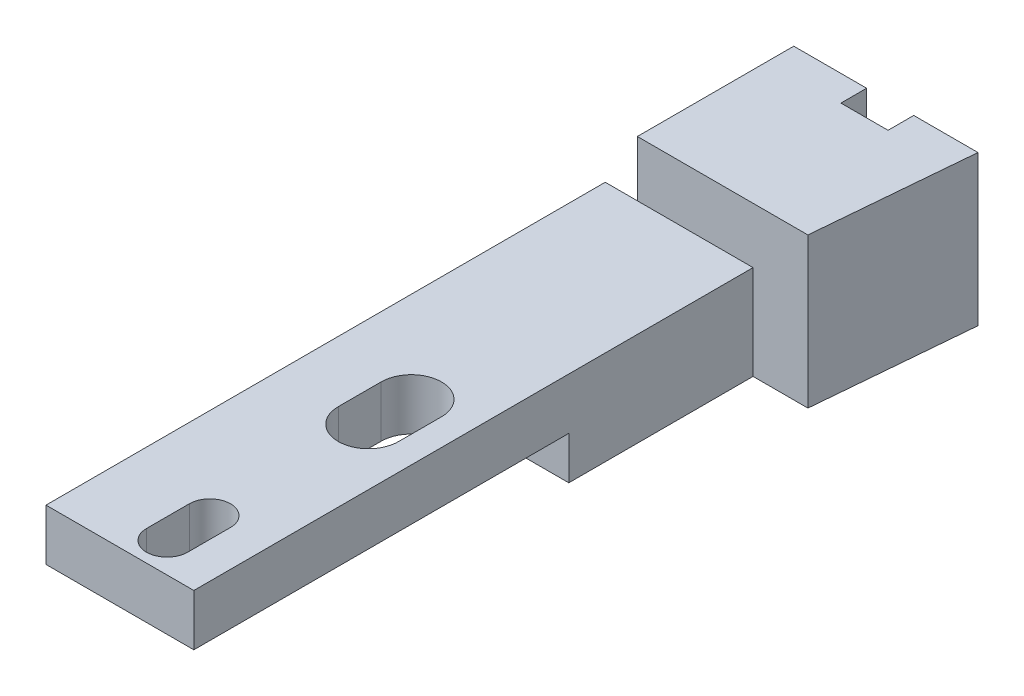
ISO-10303-21;
HEADER;
FILE_DESCRIPTION(('STEP AP214'),'2;1');
FILE_NAME('part.step','',(''),(''),'','','');
FILE_SCHEMA(('AUTOMOTIVE_DESIGN { 1 0 10303 214 1 1 1 1 }'));
ENDSEC;
DATA;
#1=APPLICATION_CONTEXT('core data for automotive mechanical design processes');
#2=APPLICATION_PROTOCOL_DEFINITION('international standard','automotive_design',2000,#1);
#3=PRODUCT_CONTEXT('',#1,'mechanical');
#4=PRODUCT('Part','Part','',(#3));
#5=PRODUCT_RELATED_PRODUCT_CATEGORY('part','',(#4));
#6=PRODUCT_DEFINITION_FORMATION('','',#4);
#7=PRODUCT_DEFINITION_CONTEXT('part definition',#1,'design');
#8=PRODUCT_DEFINITION('design','',#6,#7);
#9=PRODUCT_DEFINITION_SHAPE('','',#8);
#10=(LENGTH_UNIT() NAMED_UNIT(*) SI_UNIT(.MILLI.,.METRE.));
#11=(NAMED_UNIT(*) PLANE_ANGLE_UNIT() SI_UNIT($,.RADIAN.));
#12=(NAMED_UNIT(*) SI_UNIT($,.STERADIAN.) SOLID_ANGLE_UNIT());
#13=UNCERTAINTY_MEASURE_WITH_UNIT(LENGTH_MEASURE(1.E-05),#10,'distance_accuracy_value','');
#14=(GEOMETRIC_REPRESENTATION_CONTEXT(3) GLOBAL_UNCERTAINTY_ASSIGNED_CONTEXT((#13)) GLOBAL_UNIT_ASSIGNED_CONTEXT((#10,
#11,#12)) REPRESENTATION_CONTEXT('',''));
#15=CARTESIAN_POINT('',(0.,0.,0.));
#16=DIRECTION('',(0.,0.,1.));
#17=DIRECTION('',(1.,0.,0.));
#18=AXIS2_PLACEMENT_3D('',#15,#16,#17);
#19=CARTESIAN_POINT('',(-6.096,12.7,33.02));
#20=DIRECTION('',(0.,1.,0.));
#21=DIRECTION('',(0.,0.,1.));
#22=AXIS2_PLACEMENT_3D('',#19,#20,#21);
#23=PLANE('',#22);
#24=DIRECTION('',(0.,0.,1.));
#25=VECTOR('',#24,1.);
#26=CARTESIAN_POINT('',(0.761999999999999,12.7,9.271));
#27=LINE('',#26,#25);
#28=CARTESIAN_POINT('',(0.761999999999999,12.7,9.271));
#29=VERTEX_POINT('',#28);
#30=CARTESIAN_POINT('',(0.761999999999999,12.7,20.193));
#31=VERTEX_POINT('',#30);
#32=EDGE_CURVE('E275',#29,#31,#27,.T.);
#33=ORIENTED_EDGE('',*,*,#32,.T.);
#34=DIRECTION('',(1.,0.,0.));
#35=VECTOR('',#34,1.);
#36=CARTESIAN_POINT('',(-8.001025,12.7,20.193));
#37=LINE('',#36,#35);
#38=CARTESIAN_POINT('',(-8.001,12.7,20.193));
#39=VERTEX_POINT('',#38);
#40=EDGE_CURVE('E256',#39,#31,#37,.T.);
#41=ORIENTED_EDGE('',*,*,#40,.F.);
#42=DIRECTION('',(0.,0.,1.));
#43=VECTOR('',#42,1.);
#44=CARTESIAN_POINT('',(-8.001,12.7,9.271));
#45=LINE('',#44,#43);
#46=CARTESIAN_POINT('',(-8.001,12.7,9.271));
#47=VERTEX_POINT('',#46);
#48=EDGE_CURVE('E265',#47,#39,#45,.T.);
#49=ORIENTED_EDGE('',*,*,#48,.F.);
#50=DIRECTION('',(1.,0.,0.));
#51=VECTOR('',#50,1.);
#52=CARTESIAN_POINT('',(-9.271,12.7,9.271));
#53=LINE('',#52,#51);
#54=CARTESIAN_POINT('',(-6.096,12.7,9.271));
#55=VERTEX_POINT('',#54);
#56=EDGE_CURVE('E321',#47,#55,#53,.T.);
#57=ORIENTED_EDGE('',*,*,#56,.T.);
#58=DIRECTION('',(0.,0.,-1.));
#59=VECTOR('',#58,1.);
#60=CARTESIAN_POINT('',(-6.096,12.7,33.02));
#61=LINE('',#60,#59);
#62=CARTESIAN_POINT('',(-6.096,12.7,3.81));
#63=VERTEX_POINT('',#62);
#64=EDGE_CURVE('E336',#55,#63,#61,.T.);
#65=ORIENTED_EDGE('',*,*,#64,.T.);
#66=DIRECTION('',(-1.,0.,0.));
#67=VECTOR('',#66,1.);
#68=CARTESIAN_POINT('',(-4.953,12.7,3.81));
#69=LINE('',#68,#67);
#70=CARTESIAN_POINT('',(-4.953,12.7,3.81));
#71=VERTEX_POINT('',#70);
#72=EDGE_CURVE('E290',#71,#63,#69,.T.);
#73=ORIENTED_EDGE('',*,*,#72,.F.);
#74=DIRECTION('',(0.,0.,1.));
#75=VECTOR('',#74,1.);
#76=CARTESIAN_POINT('',(-4.953,12.7,0.));
#77=LINE('',#76,#75);
#78=CARTESIAN_POINT('',(-4.953,12.7,0.));
#79=VERTEX_POINT('',#78);
#80=EDGE_CURVE('E286',#79,#71,#77,.T.);
#81=ORIENTED_EDGE('',*,*,#80,.F.);
#82=DIRECTION('',(1.,0.,0.));
#83=VECTOR('',#82,1.);
#84=CARTESIAN_POINT('',(-6.096,12.7,0.));
#85=LINE('',#84,#83);
#86=CARTESIAN_POINT('',(-1.778,12.7,0.));
#87=VERTEX_POINT('',#86);
#88=EDGE_CURVE('E743',#79,#87,#85,.T.);
#89=ORIENTED_EDGE('',*,*,#88,.T.);
#90=DIRECTION('',(0.,0.,-1.));
#91=VECTOR('',#90,1.);
#92=CARTESIAN_POINT('',(-1.778,12.7,1.524));
#93=LINE('',#92,#91);
#94=CARTESIAN_POINT('',(-1.778,12.7,1.524));
#95=VERTEX_POINT('',#94);
#96=EDGE_CURVE('E771',#95,#87,#93,.T.);
#97=ORIENTED_EDGE('',*,*,#96,.F.);
#98=DIRECTION('',(-1.,0.,0.));
#99=VECTOR('',#98,1.);
#100=CARTESIAN_POINT('',(1.016,12.7,1.524));
#101=LINE('',#100,#99);
#102=CARTESIAN_POINT('',(1.016,12.7,1.524));
#103=VERTEX_POINT('',#102);
#104=EDGE_CURVE('E782',#103,#95,#101,.T.);
#105=ORIENTED_EDGE('',*,*,#104,.F.);
#106=DIRECTION('',(0.,0.,-1.));
#107=VECTOR('',#106,1.);
#108=CARTESIAN_POINT('',(1.016,12.7,1.524));
#109=LINE('',#108,#107);
#110=CARTESIAN_POINT('',(1.016,12.7,0.));
#111=VERTEX_POINT('',#110);
#112=EDGE_CURVE('E778',#103,#111,#109,.T.);
#113=ORIENTED_EDGE('',*,*,#112,.T.);
#114=CARTESIAN_POINT('',(4.82405952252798,12.7,0.));
#115=VERTEX_POINT('',#114);
#116=EDGE_CURVE('E742',#111,#115,#85,.T.);
#117=ORIENTED_EDGE('',*,*,#116,.T.);
#118=DIRECTION('',(0.0871557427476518,0.,-0.996194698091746));
#119=VECTOR('',#118,1.);
#120=CARTESIAN_POINT('',(4.0129521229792,12.7,9.271));
#121=LINE('',#120,#119);
#122=CARTESIAN_POINT('',(4.0129521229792,12.7,9.271));
#123=VERTEX_POINT('',#122);
#124=EDGE_CURVE('E295',#123,#115,#121,.T.);
#125=ORIENTED_EDGE('',*,*,#124,.F.);
#126=DIRECTION('',(-1.,0.,0.));
#127=VECTOR('',#126,1.);
#128=CARTESIAN_POINT('',(5.334,12.7,9.271));
#129=LINE('',#128,#127);
#130=EDGE_CURVE('E736',#123,#29,#129,.T.);
#131=ORIENTED_EDGE('',*,*,#130,.T.);
#132=EDGE_LOOP('',(#33,#41,#49,#57,#65,#73,#81,#89,#97,#105,#113,#117,#125,#131));
#133=FACE_BOUND('',#132,.T.);
#134=ADVANCED_FACE('F33',(#133),#23,.F.);
#135=CARTESIAN_POINT('',(-9.271,19.05,9.271));
#136=DIRECTION('',(0.,0.,1.));
#137=DIRECTION('',(1.,0.,0.));
#138=AXIS2_PLACEMENT_3D('',#135,#136,#137);
#139=PLANE('',#138);
#140=DIRECTION('',(0.,-1.,0.));
#141=VECTOR('',#140,1.);
#142=CARTESIAN_POINT('',(-8.001,18.288,9.271));
#143=LINE('',#142,#141);
#144=CARTESIAN_POINT('',(-8.001,18.288,9.271));
#145=VERTEX_POINT('',#144);
#146=EDGE_CURVE('E260',#145,#47,#143,.T.);
#147=ORIENTED_EDGE('',*,*,#146,.F.);
#148=DIRECTION('',(-1.,0.,0.));
#149=VECTOR('',#148,1.);
#150=CARTESIAN_POINT('',(0.888999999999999,18.288,9.271));
#151=LINE('',#150,#149);
#152=CARTESIAN_POINT('',(-6.096,18.288,9.271));
#153=VERTEX_POINT('',#152);
#154=EDGE_CURVE('E305',#153,#145,#151,.T.);
#155=ORIENTED_EDGE('',*,*,#154,.F.);
#156=DIRECTION('',(0.,-1.,0.));
#157=VECTOR('',#156,1.);
#158=CARTESIAN_POINT('',(-6.096,19.05,9.271));
#159=LINE('',#158,#157);
#160=EDGE_CURVE('E312',#153,#55,#159,.T.);
#161=ORIENTED_EDGE('',*,*,#160,.T.);
#162=ORIENTED_EDGE('',*,*,#56,.F.);
#163=EDGE_LOOP('',(#147,#155,#161,#162));
#164=FACE_BOUND('',#163,.T.);
#165=ADVANCED_FACE('F371',(#164),#139,.F.);
#166=CARTESIAN_POINT('',(0.888999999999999,12.7,42.418));
#167=DIRECTION('',(0.,0.,-1.));
#168=DIRECTION('',(-1.,0.,0.));
#169=AXIS2_PLACEMENT_3D('',#166,#167,#168);
#170=PLANE('',#169);
#171=DIRECTION('',(0.,1.,0.));
#172=VECTOR('',#171,1.);
#173=CARTESIAN_POINT('',(-8.001,18.288,42.418));
#174=LINE('',#173,#172);
#175=CARTESIAN_POINT('',(-8.001,15.24,42.418));
#176=VERTEX_POINT('',#175);
#177=CARTESIAN_POINT('',(-8.001,18.288,42.418));
#178=VERTEX_POINT('',#177);
#179=EDGE_CURVE('E268',#176,#178,#174,.T.);
#180=ORIENTED_EDGE('',*,*,#179,.F.);
#181=DIRECTION('',(1.,0.,0.));
#182=VECTOR('',#181,1.);
#183=CARTESIAN_POINT('',(-8.001025,15.24,42.418));
#184=LINE('',#183,#182);
#185=CARTESIAN_POINT('',(0.761999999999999,15.24,42.418));
#186=VERTEX_POINT('',#185);
#187=EDGE_CURVE('E257',#176,#186,#184,.T.);
#188=ORIENTED_EDGE('',*,*,#187,.T.);
#189=DIRECTION('',(0.,1.,0.));
#190=VECTOR('',#189,1.);
#191=CARTESIAN_POINT('',(0.761999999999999,18.288,42.418));
#192=LINE('',#191,#190);
#193=CARTESIAN_POINT('',(0.761999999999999,18.288,42.418));
#194=VERTEX_POINT('',#193);
#195=EDGE_CURVE('E278',#186,#194,#192,.T.);
#196=ORIENTED_EDGE('',*,*,#195,.T.);
#197=DIRECTION('',(1.,0.,0.));
#198=VECTOR('',#197,1.);
#199=CARTESIAN_POINT('',(0.888999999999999,18.288,42.418));
#200=LINE('',#199,#198);
#201=EDGE_CURVE('E309',#178,#194,#200,.T.);
#202=ORIENTED_EDGE('',*,*,#201,.F.);
#203=EDGE_LOOP('',(#180,#188,#196,#202));
#204=FACE_BOUND('',#203,.T.);
#205=ADVANCED_FACE('F376',(#204),#170,.F.);
#206=CARTESIAN_POINT('',(0.888999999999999,18.288,42.418));
#207=DIRECTION('',(0.,-1.,0.));
#208=DIRECTION('',(0.,0.,-1.));
#209=AXIS2_PLACEMENT_3D('',#206,#207,#208);
#210=PLANE('',#209);
#211=DIRECTION('',(0.,0.,-1.));
#212=VECTOR('',#211,1.);
#213=CARTESIAN_POINT('',(-0.812799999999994,18.288,26.162));
#214=LINE('',#213,#212);
#215=CARTESIAN_POINT('',(-0.812799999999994,18.288,28.702));
#216=VERTEX_POINT('',#215);
#217=CARTESIAN_POINT('',(-0.812799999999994,18.288,26.162));
#218=VERTEX_POINT('',#217);
#219=EDGE_CURVE('E233',#216,#218,#214,.T.);
#220=ORIENTED_EDGE('',*,*,#219,.F.);
#221=CARTESIAN_POINT('',(-2.6035,18.288,28.702));
#222=DIRECTION('',(0.,1.,0.));
#223=DIRECTION('',(0.,0.,1.));
#224=AXIS2_PLACEMENT_3D('',#221,#222,#223);
#225=CIRCLE('',#224,1.7907);
#226=CARTESIAN_POINT('',(-4.3942,18.288,28.702));
#227=VERTEX_POINT('',#226);
#228=EDGE_CURVE('E228',#227,#216,#225,.T.);
#229=ORIENTED_EDGE('',*,*,#228,.F.);
#230=DIRECTION('',(0.,0.,1.));
#231=VECTOR('',#230,1.);
#232=CARTESIAN_POINT('',(-4.3942,18.288,28.702));
#233=LINE('',#232,#231);
#234=CARTESIAN_POINT('',(-4.3942,18.288,26.162));
#235=VERTEX_POINT('',#234);
#236=EDGE_CURVE('E239',#235,#227,#233,.T.);
#237=ORIENTED_EDGE('',*,*,#236,.F.);
#238=CARTESIAN_POINT('',(-2.6035,18.288,26.162));
#239=DIRECTION('',(0.,1.,0.));
#240=DIRECTION('',(0.,0.,-1.));
#241=AXIS2_PLACEMENT_3D('',#238,#239,#240);
#242=CIRCLE('',#241,1.7907);
#243=EDGE_CURVE('E236',#218,#235,#242,.T.);
#244=ORIENTED_EDGE('',*,*,#243,.F.);
#245=EDGE_LOOP('',(#220,#229,#237,#244));
#246=FACE_BOUND('',#245,.T.);
#247=DIRECTION('',(0.,0.,-1.));
#248=VECTOR('',#247,1.);
#249=CARTESIAN_POINT('',(-1.3843,18.288,38.1));
#250=LINE('',#249,#248);
#251=CARTESIAN_POINT('',(-1.3843,18.288,40.64));
#252=VERTEX_POINT('',#251);
#253=CARTESIAN_POINT('',(-1.3843,18.288,38.1));
#254=VERTEX_POINT('',#253);
#255=EDGE_CURVE('E48',#252,#254,#250,.T.);
#256=ORIENTED_EDGE('',*,*,#255,.F.);
#257=CARTESIAN_POINT('',(-2.60349999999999,18.288,40.64));
#258=DIRECTION('',(0.,1.,0.));
#259=DIRECTION('',(0.,0.,1.));
#260=AXIS2_PLACEMENT_3D('',#257,#258,#259);
#261=CIRCLE('',#260,1.2192);
#262=CARTESIAN_POINT('',(-3.82269999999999,18.288,40.64));
#263=VERTEX_POINT('',#262);
#264=EDGE_CURVE('E216',#263,#252,#261,.T.);
#265=ORIENTED_EDGE('',*,*,#264,.F.);
#266=DIRECTION('',(0.,0.,1.));
#267=VECTOR('',#266,1.);
#268=CARTESIAN_POINT('',(-3.82269999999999,18.288,40.64));
#269=LINE('',#268,#267);
#270=CARTESIAN_POINT('',(-3.82269999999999,18.288,38.1));
#271=VERTEX_POINT('',#270);
#272=EDGE_CURVE('E220',#271,#263,#269,.T.);
#273=ORIENTED_EDGE('',*,*,#272,.F.);
#274=CARTESIAN_POINT('',(-2.60349999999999,18.288,38.1));
#275=DIRECTION('',(0.,1.,0.));
#276=DIRECTION('',(0.,0.,-1.));
#277=AXIS2_PLACEMENT_3D('',#274,#275,#276);
#278=CIRCLE('',#277,1.2192);
#279=EDGE_CURVE('E205',#254,#271,#278,.T.);
#280=ORIENTED_EDGE('',*,*,#279,.F.);
#281=EDGE_LOOP('',(#256,#265,#273,#280));
#282=FACE_BOUND('',#281,.T.);
#283=DIRECTION('',(0.,0.,-1.));
#284=VECTOR('',#283,1.);
#285=CARTESIAN_POINT('',(-8.001,18.288,9.271));
#286=LINE('',#285,#284);
#287=EDGE_CURVE('E270',#178,#145,#286,.T.);
#288=ORIENTED_EDGE('',*,*,#287,.F.);
#289=ORIENTED_EDGE('',*,*,#201,.T.);
#290=DIRECTION('',(0.,0.,-1.));
#291=VECTOR('',#290,1.);
#292=CARTESIAN_POINT('',(0.761999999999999,18.288,9.271));
#293=LINE('',#292,#291);
#294=CARTESIAN_POINT('',(0.761999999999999,18.288,9.271));
#295=VERTEX_POINT('',#294);
#296=EDGE_CURVE('E280',#194,#295,#293,.T.);
#297=ORIENTED_EDGE('',*,*,#296,.T.);
#298=EDGE_CURVE('E307',#295,#153,#151,.T.);
#299=ORIENTED_EDGE('',*,*,#298,.T.);
#300=ORIENTED_EDGE('',*,*,#154,.T.);
#301=EDGE_LOOP('',(#288,#289,#297,#299,#300));
#302=FACE_BOUND('',#301,.T.);
#303=ADVANCED_FACE('F218',(#246,#282,#302),#210,.F.);
#304=CARTESIAN_POINT('',(-6.096,12.7,33.02));
#305=DIRECTION('',(1.,0.,0.));
#306=DIRECTION('',(0.,0.,-1.));
#307=AXIS2_PLACEMENT_3D('',#304,#305,#306);
#308=PLANE('',#307);
#309=DIRECTION('',(0.,-1.,0.));
#310=VECTOR('',#309,1.);
#311=CARTESIAN_POINT('',(-6.096,12.7,0.));
#312=LINE('',#311,#310);
#313=CARTESIAN_POINT('',(-6.096,21.59,0.));
#314=VERTEX_POINT('',#313);
#315=CARTESIAN_POINT('',(-6.096,16.51,0.));
#316=VERTEX_POINT('',#315);
#317=EDGE_CURVE('E738',#314,#316,#312,.T.);
#318=ORIENTED_EDGE('',*,*,#317,.T.);
#319=DIRECTION('',(0.,0.707106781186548,-0.707106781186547));
#320=VECTOR('',#319,1.);
#321=CARTESIAN_POINT('',(-6.096,16.51,0.));
#322=LINE('',#321,#320);
#323=EDGE_CURVE('E283',#63,#316,#322,.T.);
#324=ORIENTED_EDGE('',*,*,#323,.F.);
#325=ORIENTED_EDGE('',*,*,#64,.F.);
#326=ORIENTED_EDGE('',*,*,#160,.F.);
#327=DIRECTION('',(0.,1.,0.));
#328=VECTOR('',#327,1.);
#329=CARTESIAN_POINT('',(-6.096,19.05,9.271));
#330=LINE('',#329,#328);
#331=CARTESIAN_POINT('',(-6.096,21.59,9.271));
#332=VERTEX_POINT('',#331);
#333=EDGE_CURVE('E324',#153,#332,#330,.T.);
#334=ORIENTED_EDGE('',*,*,#333,.T.);
#335=DIRECTION('',(0.,0.,-1.));
#336=VECTOR('',#335,1.);
#337=CARTESIAN_POINT('',(-6.096,21.59,33.02));
#338=LINE('',#337,#336);
#339=EDGE_CURVE('E748',#332,#314,#338,.T.);
#340=ORIENTED_EDGE('',*,*,#339,.T.);
#341=EDGE_LOOP('',(#318,#324,#325,#326,#334,#340));
#342=FACE_BOUND('',#341,.T.);
#343=ADVANCED_FACE('F35',(#342),#308,.F.);
#344=CARTESIAN_POINT('',(-6.096,21.59,0.));
#345=DIRECTION('',(0.,0.,-1.));
#346=DIRECTION('',(-1.,0.,0.));
#347=AXIS2_PLACEMENT_3D('',#344,#345,#346);
#348=PLANE('',#347);
#349=DIRECTION('',(0.,-1.,0.));
#350=VECTOR('',#349,1.);
#351=CARTESIAN_POINT('',(4.82405952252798,21.59,0.));
#352=LINE('',#351,#350);
#353=CARTESIAN_POINT('',(4.82405952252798,21.59,0.));
#354=VERTEX_POINT('',#353);
#355=EDGE_CURVE('E302',#354,#115,#352,.T.);
#356=ORIENTED_EDGE('',*,*,#355,.T.);
#357=ORIENTED_EDGE('',*,*,#116,.F.);
#358=DIRECTION('',(0.,-1.,0.));
#359=VECTOR('',#358,1.);
#360=CARTESIAN_POINT('',(1.016,21.59,0.));
#361=LINE('',#360,#359);
#362=CARTESIAN_POINT('',(1.016,21.59,0.));
#363=VERTEX_POINT('',#362);
#364=EDGE_CURVE('E332',#363,#111,#361,.T.);
#365=ORIENTED_EDGE('',*,*,#364,.F.);
#366=DIRECTION('',(-1.,0.,0.));
#367=VECTOR('',#366,1.);
#368=CARTESIAN_POINT('',(-6.096,21.59,0.));
#369=LINE('',#368,#367);
#370=EDGE_CURVE('E746',#354,#363,#369,.T.);
#371=ORIENTED_EDGE('',*,*,#370,.F.);
#372=EDGE_LOOP('',(#356,#357,#365,#371));
#373=FACE_BOUND('',#372,.T.);
#374=CARTESIAN_POINT('',(2.794,19.05,0.));
#375=DIRECTION('',(0.,0.,-1.));
#376=DIRECTION('',(0.,1.,0.));
#377=AXIS2_PLACEMENT_3D('',#374,#375,#376);
#378=CIRCLE('',#377,0.793749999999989);
#379=CARTESIAN_POINT('',(2.794,19.84375,0.));
#380=VERTEX_POINT('',#379);
#381=EDGE_CURVE('E709',#380,#380,#378,.T.);
#382=ORIENTED_EDGE('',*,*,#381,.F.);
#383=EDGE_LOOP('',(#382));
#384=FACE_BOUND('',#383,.T.);
#385=CARTESIAN_POINT('',(2.794,15.24,0.));
#386=DIRECTION('',(0.,0.,-1.));
#387=DIRECTION('',(0.,1.,0.));
#388=AXIS2_PLACEMENT_3D('',#385,#386,#387);
#389=CIRCLE('',#388,0.888999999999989);
#390=CARTESIAN_POINT('',(2.794,16.129,0.));
#391=VERTEX_POINT('',#390);
#392=EDGE_CURVE('E712',#391,#391,#389,.T.);
#393=ORIENTED_EDGE('',*,*,#392,.F.);
#394=EDGE_LOOP('',(#393));
#395=FACE_BOUND('',#394,.T.);
#396=ADVANCED_FACE('F384',(#373,#384,#395),#348,.T.);
#397=CARTESIAN_POINT('',(-6.096,21.59,33.02));
#398=DIRECTION('',(0.,-1.,0.));
#399=DIRECTION('',(0.,0.,-1.));
#400=AXIS2_PLACEMENT_3D('',#397,#398,#399);
#401=PLANE('',#400);
#402=DIRECTION('',(-1.,0.,0.));
#403=VECTOR('',#402,1.);
#404=CARTESIAN_POINT('',(5.334,21.59,9.271));
#405=LINE('',#404,#403);
#406=CARTESIAN_POINT('',(4.0129521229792,21.59,9.271));
#407=VERTEX_POINT('',#406);
#408=EDGE_CURVE('E327',#407,#332,#405,.T.);
#409=ORIENTED_EDGE('',*,*,#408,.F.);
#410=DIRECTION('',(0.0871557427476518,0.,-0.996194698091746));
#411=VECTOR('',#410,1.);
#412=CARTESIAN_POINT('',(4.0129521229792,21.59,9.271));
#413=LINE('',#412,#411);
#414=EDGE_CURVE('E297',#407,#354,#413,.T.);
#415=ORIENTED_EDGE('',*,*,#414,.T.);
#416=ORIENTED_EDGE('',*,*,#370,.T.);
#417=DIRECTION('',(0.,0.,-1.));
#418=VECTOR('',#417,1.);
#419=CARTESIAN_POINT('',(1.016,21.59,1.524));
#420=LINE('',#419,#418);
#421=CARTESIAN_POINT('',(1.016,21.59,1.524));
#422=VERTEX_POINT('',#421);
#423=EDGE_CURVE('E721',#422,#363,#420,.T.);
#424=ORIENTED_EDGE('',*,*,#423,.F.);
#425=DIRECTION('',(1.,0.,0.));
#426=VECTOR('',#425,1.);
#427=CARTESIAN_POINT('',(1.016,21.59,1.524));
#428=LINE('',#427,#426);
#429=CARTESIAN_POINT('',(-1.778,21.59,1.524));
#430=VERTEX_POINT('',#429);
#431=EDGE_CURVE('E789',#430,#422,#428,.T.);
#432=ORIENTED_EDGE('',*,*,#431,.F.);
#433=DIRECTION('',(0.,0.,-1.));
#434=VECTOR('',#433,1.);
#435=CARTESIAN_POINT('',(-1.778,21.59,1.524));
#436=LINE('',#435,#434);
#437=CARTESIAN_POINT('',(-1.778,21.59,0.));
#438=VERTEX_POINT('',#437);
#439=EDGE_CURVE('E777',#430,#438,#436,.T.);
#440=ORIENTED_EDGE('',*,*,#439,.T.);
#441=EDGE_CURVE('E745',#438,#314,#369,.T.);
#442=ORIENTED_EDGE('',*,*,#441,.T.);
#443=ORIENTED_EDGE('',*,*,#339,.F.);
#444=EDGE_LOOP('',(#409,#415,#416,#424,#432,#440,#442,#443));
#445=FACE_BOUND('',#444,.T.);
#446=ADVANCED_FACE('F380',(#445),#401,.F.);
#447=CARTESIAN_POINT('',(5.334,12.7,9.271));
#448=DIRECTION('',(0.,0.,-1.));
#449=DIRECTION('',(-1.,0.,0.));
#450=AXIS2_PLACEMENT_3D('',#447,#448,#449);
#451=PLANE('',#450);
#452=ORIENTED_EDGE('',*,*,#130,.F.);
#453=DIRECTION('',(0.,-1.,0.));
#454=VECTOR('',#453,1.);
#455=CARTESIAN_POINT('',(4.0129521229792,21.59,9.271));
#456=LINE('',#455,#454);
#457=EDGE_CURVE('E300',#407,#123,#456,.T.);
#458=ORIENTED_EDGE('',*,*,#457,.F.);
#459=ORIENTED_EDGE('',*,*,#408,.T.);
#460=ORIENTED_EDGE('',*,*,#333,.F.);
#461=ORIENTED_EDGE('',*,*,#298,.F.);
#462=DIRECTION('',(0.,-1.,0.));
#463=VECTOR('',#462,1.);
#464=CARTESIAN_POINT('',(0.761999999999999,18.288,9.271));
#465=LINE('',#464,#463);
#466=EDGE_CURVE('E272',#295,#29,#465,.T.);
#467=ORIENTED_EDGE('',*,*,#466,.T.);
#468=EDGE_LOOP('',(#452,#458,#459,#460,#461,#467));
#469=FACE_BOUND('',#468,.T.);
#470=ADVANCED_FACE('F383',(#469),#451,.F.);
#471=DIRECTION('',(-1.,0.,0.));
#472=VECTOR('',#471,1.);
#473=CARTESIAN_POINT('',(-4.953,16.51,0.));
#474=LINE('',#473,#472);
#475=CARTESIAN_POINT('',(-4.953,16.51,0.));
#476=VERTEX_POINT('',#475);
#477=EDGE_CURVE('E292',#476,#316,#474,.T.);
#478=ORIENTED_EDGE('',*,*,#477,.T.);
#479=ORIENTED_EDGE('',*,*,#317,.F.);
#480=ORIENTED_EDGE('',*,*,#441,.F.);
#481=DIRECTION('',(0.,1.,0.));
#482=VECTOR('',#481,1.);
#483=CARTESIAN_POINT('',(-1.778,21.59,0.));
#484=LINE('',#483,#482);
#485=EDGE_CURVE('E772',#87,#438,#484,.T.);
#486=ORIENTED_EDGE('',*,*,#485,.F.);
#487=ORIENTED_EDGE('',*,*,#88,.F.);
#488=DIRECTION('',(0.,-1.,0.));
#489=VECTOR('',#488,1.);
#490=CARTESIAN_POINT('',(-4.953,12.7,0.));
#491=LINE('',#490,#489);
#492=EDGE_CURVE('E284',#476,#79,#491,.T.);
#493=ORIENTED_EDGE('',*,*,#492,.F.);
#494=EDGE_LOOP('',(#478,#479,#480,#486,#487,#493));
#495=FACE_BOUND('',#494,.T.);
#496=CARTESIAN_POINT('',(-3.556,19.05,0.));
#497=DIRECTION('',(0.,0.,-1.));
#498=DIRECTION('',(0.,1.,0.));
#499=AXIS2_PLACEMENT_3D('',#496,#497,#498);
#500=CIRCLE('',#499,0.888999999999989);
#501=CARTESIAN_POINT('',(-3.556,19.939,0.));
#502=VERTEX_POINT('',#501);
#503=EDGE_CURVE('E718',#502,#502,#500,.T.);
#504=ORIENTED_EDGE('',*,*,#503,.F.);
#505=EDGE_LOOP('',(#504));
#506=FACE_BOUND('',#505,.T.);
#507=CARTESIAN_POINT('',(-3.556,15.24,0.));
#508=DIRECTION('',(0.,0.,-1.));
#509=DIRECTION('',(0.,1.,0.));
#510=AXIS2_PLACEMENT_3D('',#507,#508,#509);
#511=CIRCLE('',#510,0.793749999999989);
#512=CARTESIAN_POINT('',(-3.556,16.03375,0.));
#513=VERTEX_POINT('',#512);
#514=EDGE_CURVE('E328',#513,#513,#511,.T.);
#515=ORIENTED_EDGE('',*,*,#514,.F.);
#516=EDGE_LOOP('',(#515));
#517=FACE_BOUND('',#516,.T.);
#518=ADVANCED_FACE('F386',(#495,#506,#517),#348,.T.);
#519=CARTESIAN_POINT('',(-3.556,15.24,0.));
#520=DIRECTION('',(0.,0.,-1.));
#521=DIRECTION('',(0.,1.,0.));
#522=AXIS2_PLACEMENT_3D('',#519,#520,#521);
#523=CYLINDRICAL_SURFACE('',#522,0.793749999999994);
#524=CARTESIAN_POINT('',(-3.556,15.24,4.318));
#525=DIRECTION('',(0.,0.,-1.));
#526=DIRECTION('',(0.,1.,0.));
#527=AXIS2_PLACEMENT_3D('',#524,#525,#526);
#528=CIRCLE('',#527,0.793749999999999);
#529=CARTESIAN_POINT('',(-3.556,16.03375,4.318));
#530=VERTEX_POINT('',#529);
#531=EDGE_CURVE('E731',#530,#530,#528,.T.);
#532=ORIENTED_EDGE('',*,*,#531,.F.);
#533=EDGE_LOOP('',(#532));
#534=FACE_BOUND('',#533,.T.);
#535=ORIENTED_EDGE('',*,*,#514,.T.);
#536=EDGE_LOOP('',(#535));
#537=FACE_BOUND('',#536,.T.);
#538=ADVANCED_FACE('F389',(#534,#537),#523,.F.);
#539=CARTESIAN_POINT('',(-3.556,15.24,4.318));
#540=DIRECTION('',(0.,0.,-1.));
#541=DIRECTION('',(0.,1.,0.));
#542=AXIS2_PLACEMENT_3D('',#539,#540,#541);
#543=CONICAL_SURFACE('',#542,0.793749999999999,1.02974425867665);
#544=CARTESIAN_POINT('',(-3.556,15.24,4.79493311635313));
#545=VERTEX_POINT('',#544);
#546=VERTEX_LOOP('',#545);
#547=FACE_BOUND('',#546,.T.);
#548=ORIENTED_EDGE('',*,*,#531,.T.);
#549=EDGE_LOOP('',(#548));
#550=FACE_BOUND('',#549,.T.);
#551=ADVANCED_FACE('F396',(#547,#550),#543,.F.);
#552=CARTESIAN_POINT('',(2.794,19.05,0.));
#553=DIRECTION('',(0.,0.,-1.));
#554=DIRECTION('',(0.,1.,0.));
#555=AXIS2_PLACEMENT_3D('',#552,#553,#554);
#556=CYLINDRICAL_SURFACE('',#555,0.793749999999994);
#557=CARTESIAN_POINT('',(2.794,19.05,4.318));
#558=DIRECTION('',(0.,0.,-1.));
#559=DIRECTION('',(0.,1.,0.));
#560=AXIS2_PLACEMENT_3D('',#557,#558,#559);
#561=CIRCLE('',#560,0.793749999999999);
#562=CARTESIAN_POINT('',(2.794,19.84375,4.318));
#563=VERTEX_POINT('',#562);
#564=EDGE_CURVE('E727',#563,#563,#561,.T.);
#565=ORIENTED_EDGE('',*,*,#564,.F.);
#566=EDGE_LOOP('',(#565));
#567=FACE_BOUND('',#566,.T.);
#568=ORIENTED_EDGE('',*,*,#381,.T.);
#569=EDGE_LOOP('',(#568));
#570=FACE_BOUND('',#569,.T.);
#571=ADVANCED_FACE('F400',(#567,#570),#556,.F.);
#572=CARTESIAN_POINT('',(2.794,19.05,4.318));
#573=DIRECTION('',(0.,0.,-1.));
#574=DIRECTION('',(0.,1.,0.));
#575=AXIS2_PLACEMENT_3D('',#572,#573,#574);
#576=CONICAL_SURFACE('',#575,0.793749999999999,1.02974425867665);
#577=CARTESIAN_POINT('',(2.794,19.05,4.79493311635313));
#578=VERTEX_POINT('',#577);
#579=VERTEX_LOOP('',#578);
#580=FACE_BOUND('',#579,.T.);
#581=ORIENTED_EDGE('',*,*,#564,.T.);
#582=EDGE_LOOP('',(#581));
#583=FACE_BOUND('',#582,.T.);
#584=ADVANCED_FACE('F404',(#580,#583),#576,.F.);
#585=CARTESIAN_POINT('',(-3.556,19.05,0.));
#586=DIRECTION('',(0.,0.,-1.));
#587=DIRECTION('',(0.,1.,0.));
#588=AXIS2_PLACEMENT_3D('',#585,#586,#587);
#589=CYLINDRICAL_SURFACE('',#588,0.888999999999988);
#590=CARTESIAN_POINT('',(-3.556,19.05,5.73277999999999));
#591=DIRECTION('',(0.,0.,-1.));
#592=DIRECTION('',(0.,1.,0.));
#593=AXIS2_PLACEMENT_3D('',#590,#591,#592);
#594=CIRCLE('',#593,0.888999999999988);
#595=CARTESIAN_POINT('',(-3.556,19.939,5.73277999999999));
#596=VERTEX_POINT('',#595);
#597=EDGE_CURVE('E714',#596,#596,#594,.T.);
#598=ORIENTED_EDGE('',*,*,#597,.F.);
#599=EDGE_LOOP('',(#598));
#600=FACE_BOUND('',#599,.T.);
#601=ORIENTED_EDGE('',*,*,#503,.T.);
#602=EDGE_LOOP('',(#601));
#603=FACE_BOUND('',#602,.T.);
#604=ADVANCED_FACE('F408',(#600,#603),#589,.F.);
#605=CARTESIAN_POINT('',(-3.556,19.05,5.73278));
#606=DIRECTION('',(0.,0.,1.));
#607=DIRECTION('',(0.,-1.,0.));
#608=AXIS2_PLACEMENT_3D('',#605,#606,#607);
#609=PLANE('',#608);
#610=ORIENTED_EDGE('',*,*,#597,.T.);
#611=EDGE_LOOP('',(#610));
#612=FACE_BOUND('',#611,.T.);
#613=ADVANCED_FACE('F412',(#612),#609,.F.);
#614=CARTESIAN_POINT('',(2.794,15.24,0.));
#615=DIRECTION('',(0.,0.,-1.));
#616=DIRECTION('',(0.,1.,0.));
#617=AXIS2_PLACEMENT_3D('',#614,#615,#616);
#618=CYLINDRICAL_SURFACE('',#617,0.888999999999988);
#619=CARTESIAN_POINT('',(2.794,15.24,5.73277999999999));
#620=DIRECTION('',(0.,0.,-1.));
#621=DIRECTION('',(0.,1.,0.));
#622=AXIS2_PLACEMENT_3D('',#619,#620,#621);
#623=CIRCLE('',#622,0.888999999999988);
#624=CARTESIAN_POINT('',(2.794,16.129,5.73277999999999));
#625=VERTEX_POINT('',#624);
#626=EDGE_CURVE('E715',#625,#625,#623,.T.);
#627=ORIENTED_EDGE('',*,*,#626,.F.);
#628=EDGE_LOOP('',(#627));
#629=FACE_BOUND('',#628,.T.);
#630=ORIENTED_EDGE('',*,*,#392,.T.);
#631=EDGE_LOOP('',(#630));
#632=FACE_BOUND('',#631,.T.);
#633=ADVANCED_FACE('F416',(#629,#632),#618,.F.);
#634=CARTESIAN_POINT('',(2.794,15.24,5.73278));
#635=DIRECTION('',(0.,0.,1.));
#636=DIRECTION('',(0.,-1.,0.));
#637=AXIS2_PLACEMENT_3D('',#634,#635,#636);
#638=PLANE('',#637);
#639=ORIENTED_EDGE('',*,*,#626,.T.);
#640=EDGE_LOOP('',(#639));
#641=FACE_BOUND('',#640,.T.);
#642=ADVANCED_FACE('F420',(#641),#638,.F.);
#643=CARTESIAN_POINT('',(1.016,21.59,1.524));
#644=DIRECTION('',(1.,0.,0.));
#645=DIRECTION('',(0.,1.,0.));
#646=AXIS2_PLACEMENT_3D('',#643,#644,#645);
#647=PLANE('',#646);
#648=ORIENTED_EDGE('',*,*,#364,.T.);
#649=ORIENTED_EDGE('',*,*,#112,.F.);
#650=DIRECTION('',(0.,-1.,0.));
#651=VECTOR('',#650,1.);
#652=CARTESIAN_POINT('',(1.016,21.59,1.524));
#653=LINE('',#652,#651);
#654=EDGE_CURVE('E315',#422,#103,#653,.T.);
#655=ORIENTED_EDGE('',*,*,#654,.F.);
#656=ORIENTED_EDGE('',*,*,#423,.T.);
#657=EDGE_LOOP('',(#648,#649,#655,#656));
#658=FACE_BOUND('',#657,.T.);
#659=ADVANCED_FACE('F424',(#658),#647,.F.);
#660=CARTESIAN_POINT('',(-1.778,21.59,1.524));
#661=DIRECTION('',(-1.,0.,0.));
#662=DIRECTION('',(0.,-1.,0.));
#663=AXIS2_PLACEMENT_3D('',#660,#661,#662);
#664=PLANE('',#663);
#665=ORIENTED_EDGE('',*,*,#485,.T.);
#666=ORIENTED_EDGE('',*,*,#439,.F.);
#667=DIRECTION('',(0.,1.,0.));
#668=VECTOR('',#667,1.);
#669=CARTESIAN_POINT('',(-1.778,21.59,1.524));
#670=LINE('',#669,#668);
#671=EDGE_CURVE('E775',#95,#430,#670,.T.);
#672=ORIENTED_EDGE('',*,*,#671,.F.);
#673=ORIENTED_EDGE('',*,*,#96,.T.);
#674=EDGE_LOOP('',(#665,#666,#672,#673));
#675=FACE_BOUND('',#674,.T.);
#676=ADVANCED_FACE('F428',(#675),#664,.F.);
#677=CARTESIAN_POINT('',(1.016,12.7,1.524));
#678=DIRECTION('',(0.,0.,-1.));
#679=DIRECTION('',(0.,1.,0.));
#680=AXIS2_PLACEMENT_3D('',#677,#678,#679);
#681=PLANE('',#680);
#682=ORIENTED_EDGE('',*,*,#654,.T.);
#683=ORIENTED_EDGE('',*,*,#104,.T.);
#684=ORIENTED_EDGE('',*,*,#671,.T.);
#685=ORIENTED_EDGE('',*,*,#431,.T.);
#686=EDGE_LOOP('',(#682,#683,#684,#685));
#687=FACE_BOUND('',#686,.T.);
#688=ADVANCED_FACE('F432',(#687),#681,.T.);
#689=CARTESIAN_POINT('',(4.0129521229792,21.59,9.271));
#690=DIRECTION('',(-0.996194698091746,0.,-0.0871557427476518));
#691=DIRECTION('',(-0.0871557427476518,0.,0.996194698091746));
#692=AXIS2_PLACEMENT_3D('',#689,#690,#691);
#693=PLANE('',#692);
#694=ORIENTED_EDGE('',*,*,#124,.T.);
#695=ORIENTED_EDGE('',*,*,#355,.F.);
#696=ORIENTED_EDGE('',*,*,#414,.F.);
#697=ORIENTED_EDGE('',*,*,#457,.T.);
#698=EDGE_LOOP('',(#694,#695,#696,#697));
#699=FACE_BOUND('',#698,.T.);
#700=ADVANCED_FACE('F435',(#699),#693,.F.);
#701=CARTESIAN_POINT('',(-4.953,16.51,0.));
#702=DIRECTION('',(0.,0.707106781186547,0.707106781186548));
#703=DIRECTION('',(0.,-0.707106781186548,0.707106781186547));
#704=AXIS2_PLACEMENT_3D('',#701,#702,#703);
#705=PLANE('',#704);
#706=ORIENTED_EDGE('',*,*,#323,.T.);
#707=ORIENTED_EDGE('',*,*,#477,.F.);
#708=DIRECTION('',(0.,0.707106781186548,-0.707106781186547));
#709=VECTOR('',#708,1.);
#710=CARTESIAN_POINT('',(-4.953,16.51,0.));
#711=LINE('',#710,#709);
#712=EDGE_CURVE('E288',#71,#476,#711,.T.);
#713=ORIENTED_EDGE('',*,*,#712,.F.);
#714=ORIENTED_EDGE('',*,*,#72,.T.);
#715=EDGE_LOOP('',(#706,#707,#713,#714));
#716=FACE_BOUND('',#715,.T.);
#717=ADVANCED_FACE('F446',(#716),#705,.F.);
#718=CARTESIAN_POINT('',(-4.953,12.7,0.));
#719=DIRECTION('',(1.,0.,0.));
#720=DIRECTION('',(0.,0.,-1.));
#721=AXIS2_PLACEMENT_3D('',#718,#719,#720);
#722=PLANE('',#721);
#723=ORIENTED_EDGE('',*,*,#492,.T.);
#724=ORIENTED_EDGE('',*,*,#80,.T.);
#725=ORIENTED_EDGE('',*,*,#712,.T.);
#726=EDGE_LOOP('',(#723,#724,#725));
#727=FACE_BOUND('',#726,.T.);
#728=ADVANCED_FACE('F450',(#727),#722,.F.);
#729=CARTESIAN_POINT('',(0.761999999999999,12.7,9.271));
#730=DIRECTION('',(-1.,0.,0.));
#731=DIRECTION('',(0.,0.,1.));
#732=AXIS2_PLACEMENT_3D('',#729,#730,#731);
#733=PLANE('',#732);
#734=ORIENTED_EDGE('',*,*,#195,.F.);
#735=DIRECTION('',(0.,0.,1.));
#736=VECTOR('',#735,1.);
#737=CARTESIAN_POINT('',(0.761999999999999,15.24,42.418));
#738=LINE('',#737,#736);
#739=CARTESIAN_POINT('',(0.761999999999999,15.24,20.193));
#740=VERTEX_POINT('',#739);
#741=EDGE_CURVE('E254',#740,#186,#738,.T.);
#742=ORIENTED_EDGE('',*,*,#741,.F.);
#743=DIRECTION('',(0.,1.,0.));
#744=VECTOR('',#743,1.);
#745=CARTESIAN_POINT('',(0.761999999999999,12.7,20.193));
#746=LINE('',#745,#744);
#747=EDGE_CURVE('E245',#31,#740,#746,.T.);
#748=ORIENTED_EDGE('',*,*,#747,.F.);
#749=ORIENTED_EDGE('',*,*,#32,.F.);
#750=ORIENTED_EDGE('',*,*,#466,.F.);
#751=ORIENTED_EDGE('',*,*,#296,.F.);
#752=EDGE_LOOP('',(#734,#742,#748,#749,#750,#751));
#753=FACE_BOUND('',#752,.T.);
#754=ADVANCED_FACE('F454',(#753),#733,.F.);
#755=CARTESIAN_POINT('',(-8.001,12.7,9.271));
#756=DIRECTION('',(-1.,0.,0.));
#757=DIRECTION('',(0.,0.,1.));
#758=AXIS2_PLACEMENT_3D('',#755,#756,#757);
#759=PLANE('',#758);
#760=DIRECTION('',(0.,0.,-1.));
#761=VECTOR('',#760,1.);
#762=CARTESIAN_POINT('',(-8.001,15.24,9.271));
#763=LINE('',#762,#761);
#764=CARTESIAN_POINT('',(-8.001,15.24,20.193));
#765=VERTEX_POINT('',#764);
#766=EDGE_CURVE('E335',#176,#765,#763,.T.);
#767=ORIENTED_EDGE('',*,*,#766,.F.);
#768=ORIENTED_EDGE('',*,*,#179,.T.);
#769=ORIENTED_EDGE('',*,*,#287,.T.);
#770=ORIENTED_EDGE('',*,*,#146,.T.);
#771=ORIENTED_EDGE('',*,*,#48,.T.);
#772=DIRECTION('',(0.,-1.,0.));
#773=VECTOR('',#772,1.);
#774=CARTESIAN_POINT('',(-8.001,12.7,20.193));
#775=LINE('',#774,#773);
#776=EDGE_CURVE('E333',#765,#39,#775,.T.);
#777=ORIENTED_EDGE('',*,*,#776,.F.);
#778=EDGE_LOOP('',(#767,#768,#769,#770,#771,#777));
#779=FACE_BOUND('',#778,.T.);
#780=ADVANCED_FACE('F458',(#779),#759,.T.);
#781=CARTESIAN_POINT('',(-8.001025,15.24,42.418));
#782=DIRECTION('',(0.,1.,0.));
#783=DIRECTION('',(0.,0.,1.));
#784=AXIS2_PLACEMENT_3D('',#781,#782,#783);
#785=PLANE('',#784);
#786=DIRECTION('',(0.,0.,1.));
#787=VECTOR('',#786,1.);
#788=CARTESIAN_POINT('',(-3.82269999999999,15.24,42.418));
#789=LINE('',#788,#787);
#790=CARTESIAN_POINT('',(-3.82269999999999,15.24,38.1));
#791=VERTEX_POINT('',#790);
#792=CARTESIAN_POINT('',(-3.82269999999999,15.24,40.64));
#793=VERTEX_POINT('',#792);
#794=EDGE_CURVE('E41',#791,#793,#789,.T.);
#795=ORIENTED_EDGE('',*,*,#794,.T.);
#796=CARTESIAN_POINT('',(-2.60349999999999,15.24,40.64));
#797=DIRECTION('',(0.,1.,0.));
#798=DIRECTION('',(0.,0.,1.));
#799=AXIS2_PLACEMENT_3D('',#796,#797,#798);
#800=CIRCLE('',#799,1.2192);
#801=CARTESIAN_POINT('',(-1.3843,15.24,40.64));
#802=VERTEX_POINT('',#801);
#803=EDGE_CURVE('E11',#793,#802,#800,.T.);
#804=ORIENTED_EDGE('',*,*,#803,.T.);
#805=DIRECTION('',(0.,0.,-1.));
#806=VECTOR('',#805,1.);
#807=CARTESIAN_POINT('',(-1.3843,15.24,42.418));
#808=LINE('',#807,#806);
#809=CARTESIAN_POINT('',(-1.3843,15.24,38.1));
#810=VERTEX_POINT('',#809);
#811=EDGE_CURVE('E350',#802,#810,#808,.T.);
#812=ORIENTED_EDGE('',*,*,#811,.T.);
#813=CARTESIAN_POINT('',(-2.60349999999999,15.24,38.1));
#814=DIRECTION('',(0.,1.,0.));
#815=DIRECTION('',(0.,0.,1.));
#816=AXIS2_PLACEMENT_3D('',#813,#814,#815);
#817=CIRCLE('',#816,1.2192);
#818=EDGE_CURVE('E208',#810,#791,#817,.T.);
#819=ORIENTED_EDGE('',*,*,#818,.T.);
#820=EDGE_LOOP('',(#795,#804,#812,#819));
#821=FACE_BOUND('',#820,.T.);
#822=ORIENTED_EDGE('',*,*,#766,.T.);
#823=DIRECTION('',(1.,0.,0.));
#824=VECTOR('',#823,1.);
#825=CARTESIAN_POINT('',(-8.001025,15.24,20.193));
#826=LINE('',#825,#824);
#827=EDGE_CURVE('E261',#765,#740,#826,.T.);
#828=ORIENTED_EDGE('',*,*,#827,.T.);
#829=ORIENTED_EDGE('',*,*,#741,.T.);
#830=ORIENTED_EDGE('',*,*,#187,.F.);
#831=EDGE_LOOP('',(#822,#828,#829,#830));
#832=FACE_BOUND('',#831,.T.);
#833=DIRECTION('',(0.,0.,1.));
#834=VECTOR('',#833,1.);
#835=CARTESIAN_POINT('',(-4.3942,15.24,42.418));
#836=LINE('',#835,#834);
#837=CARTESIAN_POINT('',(-4.3942,15.24,26.162));
#838=VERTEX_POINT('',#837);
#839=CARTESIAN_POINT('',(-4.3942,15.24,28.702));
#840=VERTEX_POINT('',#839);
#841=EDGE_CURVE('E345',#838,#840,#836,.T.);
#842=ORIENTED_EDGE('',*,*,#841,.T.);
#843=CARTESIAN_POINT('',(-2.6035,15.24,28.702));
#844=DIRECTION('',(0.,1.,0.));
#845=DIRECTION('',(0.,0.,1.));
#846=AXIS2_PLACEMENT_3D('',#843,#844,#845);
#847=CIRCLE('',#846,1.7907);
#848=CARTESIAN_POINT('',(-0.812799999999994,15.24,28.702));
#849=VERTEX_POINT('',#848);
#850=EDGE_CURVE('E347',#840,#849,#847,.T.);
#851=ORIENTED_EDGE('',*,*,#850,.T.);
#852=DIRECTION('',(0.,0.,-1.));
#853=VECTOR('',#852,1.);
#854=CARTESIAN_POINT('',(-0.812799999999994,15.24,42.418));
#855=LINE('',#854,#853);
#856=CARTESIAN_POINT('',(-0.812799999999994,15.24,26.162));
#857=VERTEX_POINT('',#856);
#858=EDGE_CURVE('E339',#849,#857,#855,.T.);
#859=ORIENTED_EDGE('',*,*,#858,.T.);
#860=CARTESIAN_POINT('',(-2.6035,15.24,26.162));
#861=DIRECTION('',(0.,1.,0.));
#862=DIRECTION('',(0.,0.,1.));
#863=AXIS2_PLACEMENT_3D('',#860,#861,#862);
#864=CIRCLE('',#863,1.7907);
#865=EDGE_CURVE('E342',#857,#838,#864,.T.);
#866=ORIENTED_EDGE('',*,*,#865,.T.);
#867=EDGE_LOOP('',(#842,#851,#859,#866));
#868=FACE_BOUND('',#867,.T.);
#869=ADVANCED_FACE('F354',(#821,#832,#868),#785,.F.);
#870=CARTESIAN_POINT('',(-8.001025,12.7,20.193));
#871=DIRECTION('',(0.,0.,-1.));
#872=DIRECTION('',(-1.,0.,0.));
#873=AXIS2_PLACEMENT_3D('',#870,#871,#872);
#874=PLANE('',#873);
#875=ORIENTED_EDGE('',*,*,#776,.T.);
#876=ORIENTED_EDGE('',*,*,#40,.T.);
#877=ORIENTED_EDGE('',*,*,#747,.T.);
#878=ORIENTED_EDGE('',*,*,#827,.F.);
#879=EDGE_LOOP('',(#875,#876,#877,#878));
#880=FACE_BOUND('',#879,.T.);
#881=ADVANCED_FACE('F463',(#880),#874,.F.);
#882=CARTESIAN_POINT('',(-2.6035,12.69995,28.702));
#883=DIRECTION('',(0.,1.,0.));
#884=DIRECTION('',(0.,0.,1.));
#885=AXIS2_PLACEMENT_3D('',#882,#883,#884);
#886=CYLINDRICAL_SURFACE('',#885,1.7907);
#887=DIRECTION('',(0.,1.,0.));
#888=VECTOR('',#887,1.);
#889=CARTESIAN_POINT('',(-4.3942,12.69995,28.702));
#890=LINE('',#889,#888);
#891=EDGE_CURVE('E242',#840,#227,#890,.T.);
#892=ORIENTED_EDGE('',*,*,#891,.T.);
#893=ORIENTED_EDGE('',*,*,#228,.T.);
#894=DIRECTION('',(0.,1.,0.));
#895=VECTOR('',#894,1.);
#896=CARTESIAN_POINT('',(-0.812799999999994,12.69995,28.702));
#897=LINE('',#896,#895);
#898=EDGE_CURVE('E241',#849,#216,#897,.T.);
#899=ORIENTED_EDGE('',*,*,#898,.F.);
#900=ORIENTED_EDGE('',*,*,#850,.F.);
#901=EDGE_LOOP('',(#892,#893,#899,#900));
#902=FACE_BOUND('',#901,.T.);
#903=ADVANCED_FACE('F466',(#902),#886,.F.);
#904=CARTESIAN_POINT('',(-4.3942,12.69995,28.702));
#905=DIRECTION('',(-1.,0.,0.));
#906=DIRECTION('',(0.,0.,1.));
#907=AXIS2_PLACEMENT_3D('',#904,#905,#906);
#908=PLANE('',#907);
#909=ORIENTED_EDGE('',*,*,#236,.T.);
#910=ORIENTED_EDGE('',*,*,#891,.F.);
#911=ORIENTED_EDGE('',*,*,#841,.F.);
#912=DIRECTION('',(0.,1.,0.));
#913=VECTOR('',#912,1.);
#914=CARTESIAN_POINT('',(-4.3942,12.69995,26.162));
#915=LINE('',#914,#913);
#916=EDGE_CURVE('E246',#838,#235,#915,.T.);
#917=ORIENTED_EDGE('',*,*,#916,.T.);
#918=EDGE_LOOP('',(#909,#910,#911,#917));
#919=FACE_BOUND('',#918,.T.);
#920=ADVANCED_FACE('F472',(#919),#908,.F.);
#921=CARTESIAN_POINT('',(-2.6035,12.69995,26.162));
#922=DIRECTION('',(0.,1.,0.));
#923=DIRECTION('',(0.,0.,1.));
#924=AXIS2_PLACEMENT_3D('',#921,#922,#923);
#925=CYLINDRICAL_SURFACE('',#924,1.7907);
#926=DIRECTION('',(0.,1.,0.));
#927=VECTOR('',#926,1.);
#928=CARTESIAN_POINT('',(-0.812799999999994,12.69995,26.162));
#929=LINE('',#928,#927);
#930=EDGE_CURVE('E248',#857,#218,#929,.T.);
#931=ORIENTED_EDGE('',*,*,#930,.T.);
#932=ORIENTED_EDGE('',*,*,#243,.T.);
#933=ORIENTED_EDGE('',*,*,#916,.F.);
#934=ORIENTED_EDGE('',*,*,#865,.F.);
#935=EDGE_LOOP('',(#931,#932,#933,#934));
#936=FACE_BOUND('',#935,.T.);
#937=ADVANCED_FACE('F476',(#936),#925,.F.);
#938=CARTESIAN_POINT('',(-0.812799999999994,12.69995,26.162));
#939=DIRECTION('',(1.,0.,0.));
#940=DIRECTION('',(0.,0.,-1.));
#941=AXIS2_PLACEMENT_3D('',#938,#939,#940);
#942=PLANE('',#941);
#943=ORIENTED_EDGE('',*,*,#219,.T.);
#944=ORIENTED_EDGE('',*,*,#930,.F.);
#945=ORIENTED_EDGE('',*,*,#858,.F.);
#946=ORIENTED_EDGE('',*,*,#898,.T.);
#947=EDGE_LOOP('',(#943,#944,#945,#946));
#948=FACE_BOUND('',#947,.T.);
#949=ADVANCED_FACE('F368',(#948),#942,.F.);
#950=CARTESIAN_POINT('',(-2.60349999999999,12.69995,40.64));
#951=DIRECTION('',(0.,1.,0.));
#952=DIRECTION('',(0.,0.,1.));
#953=AXIS2_PLACEMENT_3D('',#950,#951,#952);
#954=CYLINDRICAL_SURFACE('',#953,1.2192);
#955=DIRECTION('',(0.,1.,0.));
#956=VECTOR('',#955,1.);
#957=CARTESIAN_POINT('',(-3.82269999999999,12.69995,40.64));
#958=LINE('',#957,#956);
#959=EDGE_CURVE('E225',#793,#263,#958,.T.);
#960=ORIENTED_EDGE('',*,*,#959,.T.);
#961=ORIENTED_EDGE('',*,*,#264,.T.);
#962=DIRECTION('',(0.,1.,0.));
#963=VECTOR('',#962,1.);
#964=CARTESIAN_POINT('',(-1.3843,12.69995,40.64));
#965=LINE('',#964,#963);
#966=EDGE_CURVE('E211',#802,#252,#965,.T.);
#967=ORIENTED_EDGE('',*,*,#966,.F.);
#968=ORIENTED_EDGE('',*,*,#803,.F.);
#969=EDGE_LOOP('',(#960,#961,#967,#968));
#970=FACE_BOUND('',#969,.T.);
#971=ADVANCED_FACE('F359',(#970),#954,.F.);
#972=CARTESIAN_POINT('',(-3.82269999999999,12.69995,40.64));
#973=DIRECTION('',(-1.,0.,0.));
#974=DIRECTION('',(0.,0.,1.));
#975=AXIS2_PLACEMENT_3D('',#972,#973,#974);
#976=PLANE('',#975);
#977=ORIENTED_EDGE('',*,*,#272,.T.);
#978=ORIENTED_EDGE('',*,*,#959,.F.);
#979=ORIENTED_EDGE('',*,*,#794,.F.);
#980=DIRECTION('',(0.,1.,0.));
#981=VECTOR('',#980,1.);
#982=CARTESIAN_POINT('',(-3.82269999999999,12.69995,38.1));
#983=LINE('',#982,#981);
#984=EDGE_CURVE('E210',#791,#271,#983,.T.);
#985=ORIENTED_EDGE('',*,*,#984,.T.);
#986=EDGE_LOOP('',(#977,#978,#979,#985));
#987=FACE_BOUND('',#986,.T.);
#988=ADVANCED_FACE('F360',(#987),#976,.F.);
#989=CARTESIAN_POINT('',(-2.60349999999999,12.69995,38.1));
#990=DIRECTION('',(0.,1.,0.));
#991=DIRECTION('',(0.,0.,1.));
#992=AXIS2_PLACEMENT_3D('',#989,#990,#991);
#993=CYLINDRICAL_SURFACE('',#992,1.2192);
#994=DIRECTION('',(0.,1.,0.));
#995=VECTOR('',#994,1.);
#996=CARTESIAN_POINT('',(-1.3843,12.69995,38.1));
#997=LINE('',#996,#995);
#998=EDGE_CURVE('E55',#810,#254,#997,.T.);
#999=ORIENTED_EDGE('',*,*,#998,.T.);
#1000=ORIENTED_EDGE('',*,*,#279,.T.);
#1001=ORIENTED_EDGE('',*,*,#984,.F.);
#1002=ORIENTED_EDGE('',*,*,#818,.F.);
#1003=EDGE_LOOP('',(#999,#1000,#1001,#1002));
#1004=FACE_BOUND('',#1003,.T.);
#1005=ADVANCED_FACE('F203',(#1004),#993,.F.);
#1006=CARTESIAN_POINT('',(-1.3843,12.69995,38.1));
#1007=DIRECTION('',(1.,0.,0.));
#1008=DIRECTION('',(0.,0.,-1.));
#1009=AXIS2_PLACEMENT_3D('',#1006,#1007,#1008);
#1010=PLANE('',#1009);
#1011=ORIENTED_EDGE('',*,*,#255,.T.);
#1012=ORIENTED_EDGE('',*,*,#998,.F.);
#1013=ORIENTED_EDGE('',*,*,#811,.F.);
#1014=ORIENTED_EDGE('',*,*,#966,.T.);
#1015=EDGE_LOOP('',(#1011,#1012,#1013,#1014));
#1016=FACE_BOUND('',#1015,.T.);
#1017=ADVANCED_FACE('F214',(#1016),#1010,.F.);
#1018=CLOSED_SHELL('',(#134,#165,#205,#303,#343,#396,#446,#470,#518,#538,#551,#571,#584,#604,
#613,#633,#642,#659,#676,#688,#700,#717,#728,#754,#780,#869,#881,#903,#920,#937,#949,#971,#988,
#1005,#1017));
#1019=MANIFOLD_SOLID_BREP('B2',#1018);
#1020=ADVANCED_BREP_SHAPE_REPRESENTATION('',(#18,#1019),#14);
#1021=SHAPE_DEFINITION_REPRESENTATION(#9,#1020);
ENDSEC;
END-ISO-10303-21;
